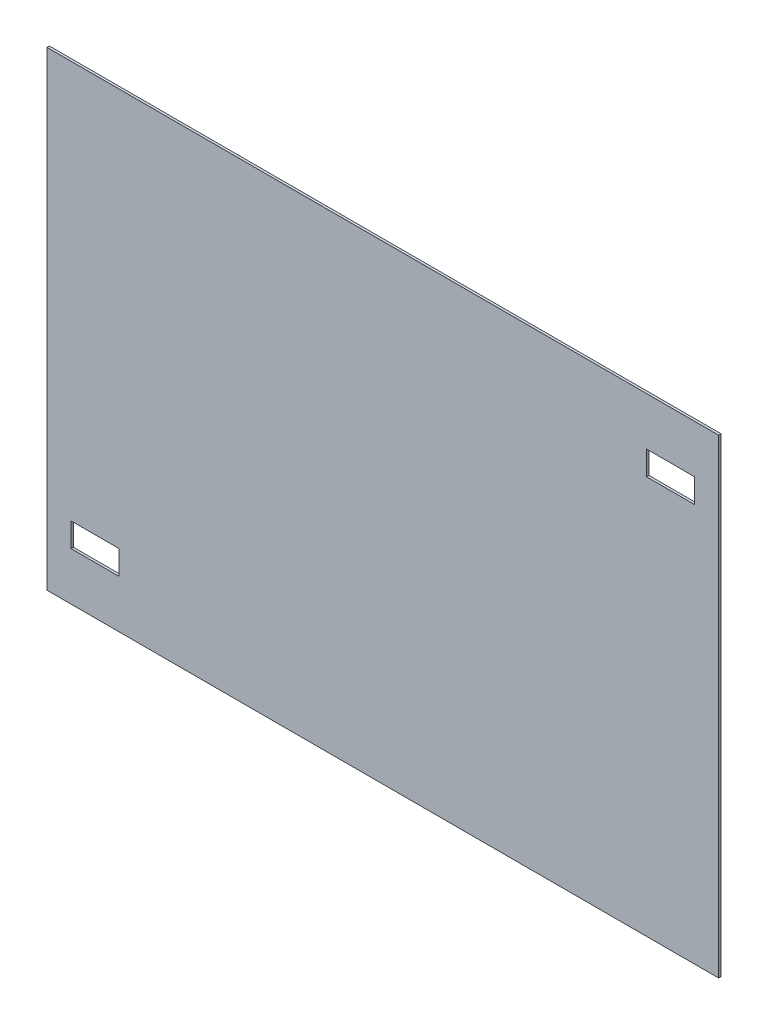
ISO-10303-21;
HEADER;
FILE_DESCRIPTION(('STEP AP214'),'2;1');
FILE_NAME('part.step','',(''),(''),'','','');
FILE_SCHEMA(('AUTOMOTIVE_DESIGN { 1 0 10303 214 1 1 1 1 }'));
ENDSEC;
DATA;
#1=APPLICATION_CONTEXT('core data for automotive mechanical design processes');
#2=APPLICATION_PROTOCOL_DEFINITION('international standard','automotive_design',2000,#1);
#3=PRODUCT_CONTEXT('',#1,'mechanical');
#4=PRODUCT('Part','Part','',(#3));
#5=PRODUCT_RELATED_PRODUCT_CATEGORY('part','',(#4));
#6=PRODUCT_DEFINITION_FORMATION('','',#4);
#7=PRODUCT_DEFINITION_CONTEXT('part definition',#1,'design');
#8=PRODUCT_DEFINITION('design','',#6,#7);
#9=PRODUCT_DEFINITION_SHAPE('','',#8);
#10=(LENGTH_UNIT() NAMED_UNIT(*) SI_UNIT(.MILLI.,.METRE.));
#11=(NAMED_UNIT(*) PLANE_ANGLE_UNIT() SI_UNIT($,.RADIAN.));
#12=(NAMED_UNIT(*) SI_UNIT($,.STERADIAN.) SOLID_ANGLE_UNIT());
#13=UNCERTAINTY_MEASURE_WITH_UNIT(LENGTH_MEASURE(1.E-05),#10,'distance_accuracy_value','');
#14=(GEOMETRIC_REPRESENTATION_CONTEXT(3) GLOBAL_UNCERTAINTY_ASSIGNED_CONTEXT((#13)) GLOBAL_UNIT_ASSIGNED_CONTEXT((#10,
#11,#12)) REPRESENTATION_CONTEXT('',''));
#15=CARTESIAN_POINT('',(0.,0.,0.));
#16=DIRECTION('',(0.,0.,1.));
#17=DIRECTION('',(1.,0.,0.));
#18=AXIS2_PLACEMENT_3D('',#15,#16,#17);
#19=CARTESIAN_POINT('',(0.,0.,10.));
#20=DIRECTION('',(1.,0.,0.));
#21=DIRECTION('',(0.,0.,-1.));
#22=AXIS2_PLACEMENT_3D('',#19,#20,#21);
#23=PLANE('',#22);
#24=DIRECTION('',(0.,-1.,0.));
#25=VECTOR('',#24,1.);
#26=CARTESIAN_POINT('',(0.,0.,0.));
#27=LINE('',#26,#25);
#28=CARTESIAN_POINT('',(0.,1955.8,0.));
#29=VERTEX_POINT('',#28);
#30=CARTESIAN_POINT('',(0.,0.,0.));
#31=VERTEX_POINT('',#30);
#32=EDGE_CURVE('E182',#29,#31,#27,.T.);
#33=ORIENTED_EDGE('',*,*,#32,.T.);
#34=DIRECTION('',(0.,0.,-1.));
#35=VECTOR('',#34,1.);
#36=CARTESIAN_POINT('',(0.,0.,10.));
#37=LINE('',#36,#35);
#38=CARTESIAN_POINT('',(0.,0.,10.));
#39=VERTEX_POINT('',#38);
#40=EDGE_CURVE('E11',#39,#31,#37,.T.);
#41=ORIENTED_EDGE('',*,*,#40,.F.);
#42=DIRECTION('',(0.,-1.,0.));
#43=VECTOR('',#42,1.);
#44=CARTESIAN_POINT('',(0.,0.,10.));
#45=LINE('',#44,#43);
#46=CARTESIAN_POINT('',(0.,1955.8,10.));
#47=VERTEX_POINT('',#46);
#48=EDGE_CURVE('E189',#47,#39,#45,.T.);
#49=ORIENTED_EDGE('',*,*,#48,.F.);
#50=DIRECTION('',(0.,0.,-1.));
#51=VECTOR('',#50,1.);
#52=CARTESIAN_POINT('',(0.,1955.8,10.));
#53=LINE('',#52,#51);
#54=EDGE_CURVE('E199',#47,#29,#53,.T.);
#55=ORIENTED_EDGE('',*,*,#54,.T.);
#56=EDGE_LOOP('',(#33,#41,#49,#55));
#57=FACE_BOUND('',#56,.T.);
#58=ADVANCED_FACE('F32',(#57),#23,.F.);
#59=CARTESIAN_POINT('',(0.,0.,10.));
#60=DIRECTION('',(0.,1.,0.));
#61=DIRECTION('',(0.,0.,1.));
#62=AXIS2_PLACEMENT_3D('',#59,#60,#61);
#63=PLANE('',#62);
#64=DIRECTION('',(1.,0.,0.));
#65=VECTOR('',#64,1.);
#66=CARTESIAN_POINT('',(0.,0.,0.));
#67=LINE('',#66,#65);
#68=CARTESIAN_POINT('',(2794.,0.,0.));
#69=VERTEX_POINT('',#68);
#70=EDGE_CURVE('E202',#31,#69,#67,.T.);
#71=ORIENTED_EDGE('',*,*,#70,.T.);
#72=DIRECTION('',(0.,0.,-1.));
#73=VECTOR('',#72,1.);
#74=CARTESIAN_POINT('',(2794.,0.,10.));
#75=LINE('',#74,#73);
#76=CARTESIAN_POINT('',(2794.,0.,10.));
#77=VERTEX_POINT('',#76);
#78=EDGE_CURVE('E39',#77,#69,#75,.T.);
#79=ORIENTED_EDGE('',*,*,#78,.F.);
#80=DIRECTION('',(1.,0.,0.));
#81=VECTOR('',#80,1.);
#82=CARTESIAN_POINT('',(0.,0.,10.));
#83=LINE('',#82,#81);
#84=EDGE_CURVE('E192',#39,#77,#83,.T.);
#85=ORIENTED_EDGE('',*,*,#84,.F.);
#86=ORIENTED_EDGE('',*,*,#40,.T.);
#87=EDGE_LOOP('',(#71,#79,#85,#86));
#88=FACE_BOUND('',#87,.T.);
#89=ADVANCED_FACE('F231',(#88),#63,.F.);
#90=CARTESIAN_POINT('',(2794.,0.,10.));
#91=DIRECTION('',(-1.,0.,0.));
#92=DIRECTION('',(0.,0.,1.));
#93=AXIS2_PLACEMENT_3D('',#90,#91,#92);
#94=PLANE('',#93);
#95=DIRECTION('',(0.,1.,0.));
#96=VECTOR('',#95,1.);
#97=CARTESIAN_POINT('',(2794.,0.,0.));
#98=LINE('',#97,#96);
#99=CARTESIAN_POINT('',(2794.,1955.8,0.));
#100=VERTEX_POINT('',#99);
#101=EDGE_CURVE('E204',#69,#100,#98,.T.);
#102=ORIENTED_EDGE('',*,*,#101,.T.);
#103=DIRECTION('',(0.,0.,-1.));
#104=VECTOR('',#103,1.);
#105=CARTESIAN_POINT('',(2794.,1955.8,10.));
#106=LINE('',#105,#104);
#107=CARTESIAN_POINT('',(2794.,1955.8,10.));
#108=VERTEX_POINT('',#107);
#109=EDGE_CURVE('E209',#108,#100,#106,.T.);
#110=ORIENTED_EDGE('',*,*,#109,.F.);
#111=DIRECTION('',(0.,1.,0.));
#112=VECTOR('',#111,1.);
#113=CARTESIAN_POINT('',(2794.,0.,10.));
#114=LINE('',#113,#112);
#115=EDGE_CURVE('E195',#77,#108,#114,.T.);
#116=ORIENTED_EDGE('',*,*,#115,.F.);
#117=ORIENTED_EDGE('',*,*,#78,.T.);
#118=EDGE_LOOP('',(#102,#110,#116,#117));
#119=FACE_BOUND('',#118,.T.);
#120=ADVANCED_FACE('F216',(#119),#94,.F.);
#121=CARTESIAN_POINT('',(0.,1955.8,10.));
#122=DIRECTION('',(0.,-1.,0.));
#123=DIRECTION('',(0.,0.,-1.));
#124=AXIS2_PLACEMENT_3D('',#121,#122,#123);
#125=PLANE('',#124);
#126=DIRECTION('',(-1.,0.,0.));
#127=VECTOR('',#126,1.);
#128=CARTESIAN_POINT('',(0.,1955.8,0.));
#129=LINE('',#128,#127);
#130=EDGE_CURVE('E193',#100,#29,#129,.T.);
#131=ORIENTED_EDGE('',*,*,#130,.T.);
#132=ORIENTED_EDGE('',*,*,#54,.F.);
#133=DIRECTION('',(-1.,0.,0.));
#134=VECTOR('',#133,1.);
#135=CARTESIAN_POINT('',(0.,1955.8,10.));
#136=LINE('',#135,#134);
#137=EDGE_CURVE('E197',#108,#47,#136,.T.);
#138=ORIENTED_EDGE('',*,*,#137,.F.);
#139=ORIENTED_EDGE('',*,*,#109,.T.);
#140=EDGE_LOOP('',(#131,#132,#138,#139));
#141=FACE_BOUND('',#140,.T.);
#142=ADVANCED_FACE('F224',(#141),#125,.F.);
#143=CARTESIAN_POINT('',(0.,0.,10.));
#144=DIRECTION('',(0.,0.,-1.));
#145=DIRECTION('',(-1.,0.,0.));
#146=AXIS2_PLACEMENT_3D('',#143,#144,#145);
#147=PLANE('',#146);
#148=DIRECTION('',(1.,0.,0.));
#149=VECTOR('',#148,1.);
#150=CARTESIAN_POINT('',(2494.,1655.8,10.));
#151=LINE('',#150,#149);
#152=CARTESIAN_POINT('',(2494.,1655.8,10.));
#153=VERTEX_POINT('',#152);
#154=CARTESIAN_POINT('',(2694.,1655.8,10.));
#155=VERTEX_POINT('',#154);
#156=EDGE_CURVE('E147',#153,#155,#151,.T.);
#157=ORIENTED_EDGE('',*,*,#156,.F.);
#158=DIRECTION('',(0.,-1.,0.));
#159=VECTOR('',#158,1.);
#160=CARTESIAN_POINT('',(2494.,1755.8,10.));
#161=LINE('',#160,#159);
#162=CARTESIAN_POINT('',(2494.,1755.8,10.));
#163=VERTEX_POINT('',#162);
#164=EDGE_CURVE('E46',#163,#153,#161,.T.);
#165=ORIENTED_EDGE('',*,*,#164,.F.);
#166=DIRECTION('',(-1.,0.,0.));
#167=VECTOR('',#166,1.);
#168=CARTESIAN_POINT('',(2494.,1755.8,10.));
#169=LINE('',#168,#167);
#170=CARTESIAN_POINT('',(2694.,1755.8,10.));
#171=VERTEX_POINT('',#170);
#172=EDGE_CURVE('E138',#171,#163,#169,.T.);
#173=ORIENTED_EDGE('',*,*,#172,.F.);
#174=DIRECTION('',(0.,1.,0.));
#175=VECTOR('',#174,1.);
#176=CARTESIAN_POINT('',(2694.,1755.8,10.));
#177=LINE('',#176,#175);
#178=EDGE_CURVE('E141',#155,#171,#177,.T.);
#179=ORIENTED_EDGE('',*,*,#178,.F.);
#180=EDGE_LOOP('',(#157,#165,#173,#179));
#181=FACE_BOUND('',#180,.T.);
#182=DIRECTION('',(1.,0.,0.));
#183=VECTOR('',#182,1.);
#184=CARTESIAN_POINT('',(100.,200.,10.));
#185=LINE('',#184,#183);
#186=CARTESIAN_POINT('',(100.,200.,10.));
#187=VERTEX_POINT('',#186);
#188=CARTESIAN_POINT('',(300.,200.,10.));
#189=VERTEX_POINT('',#188);
#190=EDGE_CURVE('E172',#187,#189,#185,.T.);
#191=ORIENTED_EDGE('',*,*,#190,.F.);
#192=DIRECTION('',(0.,-1.,0.));
#193=VECTOR('',#192,1.);
#194=CARTESIAN_POINT('',(100.,300.,10.));
#195=LINE('',#194,#193);
#196=CARTESIAN_POINT('',(100.,300.,10.));
#197=VERTEX_POINT('',#196);
#198=EDGE_CURVE('E153',#197,#187,#195,.T.);
#199=ORIENTED_EDGE('',*,*,#198,.F.);
#200=DIRECTION('',(-1.,0.,0.));
#201=VECTOR('',#200,1.);
#202=CARTESIAN_POINT('',(100.,300.,10.));
#203=LINE('',#202,#201);
#204=CARTESIAN_POINT('',(300.,300.,10.));
#205=VERTEX_POINT('',#204);
#206=EDGE_CURVE('E161',#205,#197,#203,.T.);
#207=ORIENTED_EDGE('',*,*,#206,.F.);
#208=DIRECTION('',(0.,1.,0.));
#209=VECTOR('',#208,1.);
#210=CARTESIAN_POINT('',(300.,300.,10.));
#211=LINE('',#210,#209);
#212=EDGE_CURVE('E175',#189,#205,#211,.T.);
#213=ORIENTED_EDGE('',*,*,#212,.F.);
#214=EDGE_LOOP('',(#191,#199,#207,#213));
#215=FACE_BOUND('',#214,.T.);
#216=ORIENTED_EDGE('',*,*,#48,.T.);
#217=ORIENTED_EDGE('',*,*,#84,.T.);
#218=ORIENTED_EDGE('',*,*,#115,.T.);
#219=ORIENTED_EDGE('',*,*,#137,.T.);
#220=EDGE_LOOP('',(#216,#217,#218,#219));
#221=FACE_BOUND('',#220,.T.);
#222=ADVANCED_FACE('F230',(#181,#215,#221),#147,.F.);
#223=CARTESIAN_POINT('',(0.,0.,0.));
#224=DIRECTION('',(0.,0.,-1.));
#225=DIRECTION('',(-1.,0.,0.));
#226=AXIS2_PLACEMENT_3D('',#223,#224,#225);
#227=PLANE('',#226);
#228=DIRECTION('',(0.,-1.,0.));
#229=VECTOR('',#228,1.);
#230=CARTESIAN_POINT('',(2494.,1755.8,0.));
#231=LINE('',#230,#229);
#232=CARTESIAN_POINT('',(2494.,1755.8,0.));
#233=VERTEX_POINT('',#232);
#234=CARTESIAN_POINT('',(2494.,1655.8,0.));
#235=VERTEX_POINT('',#234);
#236=EDGE_CURVE('E122',#233,#235,#231,.T.);
#237=ORIENTED_EDGE('',*,*,#236,.T.);
#238=DIRECTION('',(1.,0.,0.));
#239=VECTOR('',#238,1.);
#240=CARTESIAN_POINT('',(2494.,1655.8,0.));
#241=LINE('',#240,#239);
#242=CARTESIAN_POINT('',(2694.,1655.8,0.));
#243=VERTEX_POINT('',#242);
#244=EDGE_CURVE('E131',#235,#243,#241,.T.);
#245=ORIENTED_EDGE('',*,*,#244,.T.);
#246=DIRECTION('',(0.,1.,0.));
#247=VECTOR('',#246,1.);
#248=CARTESIAN_POINT('',(2694.,1755.8,0.));
#249=LINE('',#248,#247);
#250=CARTESIAN_POINT('',(2694.,1755.8,0.));
#251=VERTEX_POINT('',#250);
#252=EDGE_CURVE('E54',#243,#251,#249,.T.);
#253=ORIENTED_EDGE('',*,*,#252,.T.);
#254=DIRECTION('',(-1.,0.,0.));
#255=VECTOR('',#254,1.);
#256=CARTESIAN_POINT('',(2494.,1755.8,0.));
#257=LINE('',#256,#255);
#258=EDGE_CURVE('E128',#251,#233,#257,.T.);
#259=ORIENTED_EDGE('',*,*,#258,.T.);
#260=EDGE_LOOP('',(#237,#245,#253,#259));
#261=FACE_BOUND('',#260,.T.);
#262=DIRECTION('',(0.,-1.,0.));
#263=VECTOR('',#262,1.);
#264=CARTESIAN_POINT('',(100.,300.,0.));
#265=LINE('',#264,#263);
#266=CARTESIAN_POINT('',(100.,300.,0.));
#267=VERTEX_POINT('',#266);
#268=CARTESIAN_POINT('',(100.,200.,0.));
#269=VERTEX_POINT('',#268);
#270=EDGE_CURVE('E157',#267,#269,#265,.T.);
#271=ORIENTED_EDGE('',*,*,#270,.T.);
#272=DIRECTION('',(1.,0.,0.));
#273=VECTOR('',#272,1.);
#274=CARTESIAN_POINT('',(100.,200.,0.));
#275=LINE('',#274,#273);
#276=CARTESIAN_POINT('',(300.,200.,0.));
#277=VERTEX_POINT('',#276);
#278=EDGE_CURVE('E160',#269,#277,#275,.T.);
#279=ORIENTED_EDGE('',*,*,#278,.T.);
#280=DIRECTION('',(0.,1.,0.));
#281=VECTOR('',#280,1.);
#282=CARTESIAN_POINT('',(300.,300.,0.));
#283=LINE('',#282,#281);
#284=CARTESIAN_POINT('',(300.,300.,0.));
#285=VERTEX_POINT('',#284);
#286=EDGE_CURVE('E164',#277,#285,#283,.T.);
#287=ORIENTED_EDGE('',*,*,#286,.T.);
#288=DIRECTION('',(-1.,0.,0.));
#289=VECTOR('',#288,1.);
#290=CARTESIAN_POINT('',(100.,300.,0.));
#291=LINE('',#290,#289);
#292=EDGE_CURVE('E167',#285,#267,#291,.T.);
#293=ORIENTED_EDGE('',*,*,#292,.T.);
#294=EDGE_LOOP('',(#271,#279,#287,#293));
#295=FACE_BOUND('',#294,.T.);
#296=ORIENTED_EDGE('',*,*,#32,.F.);
#297=ORIENTED_EDGE('',*,*,#130,.F.);
#298=ORIENTED_EDGE('',*,*,#101,.F.);
#299=ORIENTED_EDGE('',*,*,#70,.F.);
#300=EDGE_LOOP('',(#296,#297,#298,#299));
#301=FACE_BOUND('',#300,.T.);
#302=ADVANCED_FACE('F135',(#261,#295,#301),#227,.T.);
#303=CARTESIAN_POINT('',(100.,300.,0.));
#304=DIRECTION('',(-1.,0.,0.));
#305=DIRECTION('',(0.,-1.,0.));
#306=AXIS2_PLACEMENT_3D('',#303,#304,#305);
#307=PLANE('',#306);
#308=ORIENTED_EDGE('',*,*,#198,.T.);
#309=DIRECTION('',(0.,0.,1.));
#310=VECTOR('',#309,1.);
#311=CARTESIAN_POINT('',(100.,200.,0.));
#312=LINE('',#311,#310);
#313=EDGE_CURVE('E170',#269,#187,#312,.T.);
#314=ORIENTED_EDGE('',*,*,#313,.F.);
#315=ORIENTED_EDGE('',*,*,#270,.F.);
#316=DIRECTION('',(0.,0.,1.));
#317=VECTOR('',#316,1.);
#318=CARTESIAN_POINT('',(100.,300.,0.));
#319=LINE('',#318,#317);
#320=EDGE_CURVE('E180',#267,#197,#319,.T.);
#321=ORIENTED_EDGE('',*,*,#320,.T.);
#322=EDGE_LOOP('',(#308,#314,#315,#321));
#323=FACE_BOUND('',#322,.T.);
#324=ADVANCED_FACE('F243',(#323),#307,.F.);
#325=CARTESIAN_POINT('',(100.,300.,0.));
#326=DIRECTION('',(0.,1.,0.));
#327=DIRECTION('',(0.,0.,1.));
#328=AXIS2_PLACEMENT_3D('',#325,#326,#327);
#329=PLANE('',#328);
#330=ORIENTED_EDGE('',*,*,#206,.T.);
#331=ORIENTED_EDGE('',*,*,#320,.F.);
#332=ORIENTED_EDGE('',*,*,#292,.F.);
#333=DIRECTION('',(0.,0.,1.));
#334=VECTOR('',#333,1.);
#335=CARTESIAN_POINT('',(300.,300.,0.));
#336=LINE('',#335,#334);
#337=EDGE_CURVE('E183',#285,#205,#336,.T.);
#338=ORIENTED_EDGE('',*,*,#337,.T.);
#339=EDGE_LOOP('',(#330,#331,#332,#338));
#340=FACE_BOUND('',#339,.T.);
#341=ADVANCED_FACE('F249',(#340),#329,.F.);
#342=CARTESIAN_POINT('',(300.,300.,0.));
#343=DIRECTION('',(1.,0.,0.));
#344=DIRECTION('',(0.,0.,-1.));
#345=AXIS2_PLACEMENT_3D('',#342,#343,#344);
#346=PLANE('',#345);
#347=ORIENTED_EDGE('',*,*,#212,.T.);
#348=ORIENTED_EDGE('',*,*,#337,.F.);
#349=ORIENTED_EDGE('',*,*,#286,.F.);
#350=DIRECTION('',(0.,0.,1.));
#351=VECTOR('',#350,1.);
#352=CARTESIAN_POINT('',(300.,200.,0.));
#353=LINE('',#352,#351);
#354=EDGE_CURVE('E185',#277,#189,#353,.T.);
#355=ORIENTED_EDGE('',*,*,#354,.T.);
#356=EDGE_LOOP('',(#347,#348,#349,#355));
#357=FACE_BOUND('',#356,.T.);
#358=ADVANCED_FACE('F254',(#357),#346,.F.);
#359=CARTESIAN_POINT('',(100.,200.,0.));
#360=DIRECTION('',(0.,-1.,0.));
#361=DIRECTION('',(1.,0.,0.));
#362=AXIS2_PLACEMENT_3D('',#359,#360,#361);
#363=PLANE('',#362);
#364=ORIENTED_EDGE('',*,*,#190,.T.);
#365=ORIENTED_EDGE('',*,*,#354,.F.);
#366=ORIENTED_EDGE('',*,*,#278,.F.);
#367=ORIENTED_EDGE('',*,*,#313,.T.);
#368=EDGE_LOOP('',(#364,#365,#366,#367));
#369=FACE_BOUND('',#368,.T.);
#370=ADVANCED_FACE('F251',(#369),#363,.F.);
#371=CARTESIAN_POINT('',(2494.,1755.8,0.));
#372=DIRECTION('',(-1.,0.,0.));
#373=DIRECTION('',(0.,-1.,0.));
#374=AXIS2_PLACEMENT_3D('',#371,#372,#373);
#375=PLANE('',#374);
#376=ORIENTED_EDGE('',*,*,#164,.T.);
#377=DIRECTION('',(0.,0.,1.));
#378=VECTOR('',#377,1.);
#379=CARTESIAN_POINT('',(2494.,1655.8,0.));
#380=LINE('',#379,#378);
#381=EDGE_CURVE('E118',#235,#153,#380,.T.);
#382=ORIENTED_EDGE('',*,*,#381,.F.);
#383=ORIENTED_EDGE('',*,*,#236,.F.);
#384=DIRECTION('',(0.,0.,1.));
#385=VECTOR('',#384,1.);
#386=CARTESIAN_POINT('',(2494.,1755.8,0.));
#387=LINE('',#386,#385);
#388=EDGE_CURVE('E151',#233,#163,#387,.T.);
#389=ORIENTED_EDGE('',*,*,#388,.T.);
#390=EDGE_LOOP('',(#376,#382,#383,#389));
#391=FACE_BOUND('',#390,.T.);
#392=ADVANCED_FACE('F120',(#391),#375,.F.);
#393=CARTESIAN_POINT('',(2494.,1755.8,0.));
#394=DIRECTION('',(0.,1.,0.));
#395=DIRECTION('',(0.,0.,1.));
#396=AXIS2_PLACEMENT_3D('',#393,#394,#395);
#397=PLANE('',#396);
#398=ORIENTED_EDGE('',*,*,#172,.T.);
#399=ORIENTED_EDGE('',*,*,#388,.F.);
#400=ORIENTED_EDGE('',*,*,#258,.F.);
#401=DIRECTION('',(0.,0.,1.));
#402=VECTOR('',#401,1.);
#403=CARTESIAN_POINT('',(2694.,1755.8,0.));
#404=LINE('',#403,#402);
#405=EDGE_CURVE('E154',#251,#171,#404,.T.);
#406=ORIENTED_EDGE('',*,*,#405,.T.);
#407=EDGE_LOOP('',(#398,#399,#400,#406));
#408=FACE_BOUND('',#407,.T.);
#409=ADVANCED_FACE('F264',(#408),#397,.F.);
#410=CARTESIAN_POINT('',(2694.,1755.8,0.));
#411=DIRECTION('',(1.,0.,0.));
#412=DIRECTION('',(0.,0.,-1.));
#413=AXIS2_PLACEMENT_3D('',#410,#411,#412);
#414=PLANE('',#413);
#415=ORIENTED_EDGE('',*,*,#178,.T.);
#416=ORIENTED_EDGE('',*,*,#405,.F.);
#417=ORIENTED_EDGE('',*,*,#252,.F.);
#418=DIRECTION('',(0.,0.,1.));
#419=VECTOR('',#418,1.);
#420=CARTESIAN_POINT('',(2694.,1655.8,0.));
#421=LINE('',#420,#419);
#422=EDGE_CURVE('E127',#243,#155,#421,.T.);
#423=ORIENTED_EDGE('',*,*,#422,.T.);
#424=EDGE_LOOP('',(#415,#416,#417,#423));
#425=FACE_BOUND('',#424,.T.);
#426=ADVANCED_FACE('F267',(#425),#414,.F.);
#427=CARTESIAN_POINT('',(2494.,1655.8,0.));
#428=DIRECTION('',(0.,-1.,0.));
#429=DIRECTION('',(1.,0.,0.));
#430=AXIS2_PLACEMENT_3D('',#427,#428,#429);
#431=PLANE('',#430);
#432=ORIENTED_EDGE('',*,*,#156,.T.);
#433=ORIENTED_EDGE('',*,*,#422,.F.);
#434=ORIENTED_EDGE('',*,*,#244,.F.);
#435=ORIENTED_EDGE('',*,*,#381,.T.);
#436=EDGE_LOOP('',(#432,#433,#434,#435));
#437=FACE_BOUND('',#436,.T.);
#438=ADVANCED_FACE('F132',(#437),#431,.F.);
#439=CLOSED_SHELL('',(#58,#89,#120,#142,#222,#302,#324,#341,#358,#370,#392,#409,#426,#438));
#440=MANIFOLD_SOLID_BREP('B2',#439);
#441=ADVANCED_BREP_SHAPE_REPRESENTATION('',(#18,#440),#14);
#442=SHAPE_DEFINITION_REPRESENTATION(#9,#441);
ENDSEC;
END-ISO-10303-21;
